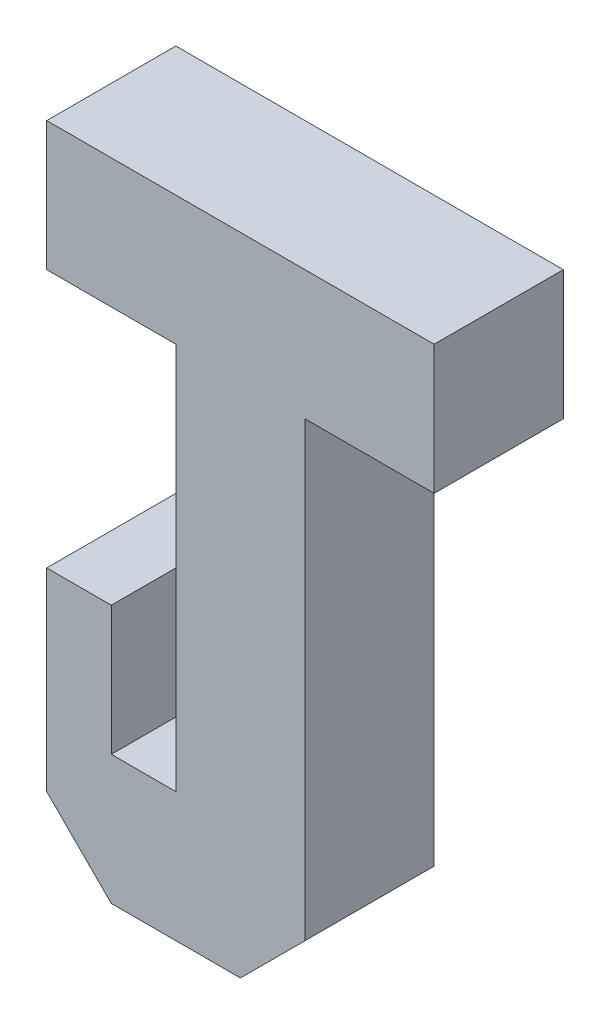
ISO-10303-21;
HEADER;
FILE_DESCRIPTION(('STEP AP214'),'2;1');
FILE_NAME('part.step','',(''),(''),'','','');
FILE_SCHEMA(('AUTOMOTIVE_DESIGN { 1 0 10303 214 1 1 1 1 }'));
ENDSEC;
DATA;
#1=APPLICATION_CONTEXT('core data for automotive mechanical design processes');
#2=APPLICATION_PROTOCOL_DEFINITION('international standard','automotive_design',2000,#1);
#3=PRODUCT_CONTEXT('',#1,'mechanical');
#4=PRODUCT('Part','Part','',(#3));
#5=PRODUCT_RELATED_PRODUCT_CATEGORY('part','',(#4));
#6=PRODUCT_DEFINITION_FORMATION('','',#4);
#7=PRODUCT_DEFINITION_CONTEXT('part definition',#1,'design');
#8=PRODUCT_DEFINITION('design','',#6,#7);
#9=PRODUCT_DEFINITION_SHAPE('','',#8);
#10=(LENGTH_UNIT() NAMED_UNIT(*) SI_UNIT(.MILLI.,.METRE.));
#11=(NAMED_UNIT(*) PLANE_ANGLE_UNIT() SI_UNIT($,.RADIAN.));
#12=(NAMED_UNIT(*) SI_UNIT($,.STERADIAN.) SOLID_ANGLE_UNIT());
#13=UNCERTAINTY_MEASURE_WITH_UNIT(LENGTH_MEASURE(1.E-05),#10,'distance_accuracy_value','');
#14=(GEOMETRIC_REPRESENTATION_CONTEXT(3) GLOBAL_UNCERTAINTY_ASSIGNED_CONTEXT((#13)) GLOBAL_UNIT_ASSIGNED_CONTEXT((#10,
#11,#12)) REPRESENTATION_CONTEXT('',''));
#15=CARTESIAN_POINT('',(0.,0.,0.));
#16=DIRECTION('',(0.,0.,1.));
#17=DIRECTION('',(1.,0.,0.));
#18=AXIS2_PLACEMENT_3D('',#15,#16,#17);
#19=CARTESIAN_POINT('',(-10.,50.,10.));
#20=DIRECTION('',(1.,0.,0.));
#21=DIRECTION('',(0.,1.,0.));
#22=AXIS2_PLACEMENT_3D('',#19,#20,#21);
#23=PLANE('',#22);
#24=DIRECTION('',(0.,-1.,0.));
#25=VECTOR('',#24,1.);
#26=CARTESIAN_POINT('',(-10.,50.,0.));
#27=LINE('',#26,#25);
#28=CARTESIAN_POINT('',(-10.,50.,0.));
#29=VERTEX_POINT('',#28);
#30=CARTESIAN_POINT('',(-10.,40.,0.));
#31=VERTEX_POINT('',#30);
#32=EDGE_CURVE('E159',#29,#31,#27,.T.);
#33=ORIENTED_EDGE('',*,*,#32,.T.);
#34=DIRECTION('',(0.,0.,-1.));
#35=VECTOR('',#34,1.);
#36=CARTESIAN_POINT('',(-10.,40.,10.));
#37=LINE('',#36,#35);
#38=CARTESIAN_POINT('',(-10.,40.,10.));
#39=VERTEX_POINT('',#38);
#40=EDGE_CURVE('E140',#39,#31,#37,.T.);
#41=ORIENTED_EDGE('',*,*,#40,.F.);
#42=DIRECTION('',(0.,-1.,0.));
#43=VECTOR('',#42,1.);
#44=CARTESIAN_POINT('',(-10.,50.,10.));
#45=LINE('',#44,#43);
#46=CARTESIAN_POINT('',(-10.,50.,10.));
#47=VERTEX_POINT('',#46);
#48=EDGE_CURVE('E147',#47,#39,#45,.T.);
#49=ORIENTED_EDGE('',*,*,#48,.F.);
#50=DIRECTION('',(0.,0.,-1.));
#51=VECTOR('',#50,1.);
#52=CARTESIAN_POINT('',(-10.,50.,10.));
#53=LINE('',#52,#51);
#54=EDGE_CURVE('E213',#47,#29,#53,.T.);
#55=ORIENTED_EDGE('',*,*,#54,.T.);
#56=EDGE_LOOP('',(#33,#41,#49,#55));
#57=FACE_BOUND('',#56,.T.);
#58=ADVANCED_FACE('F33',(#57),#23,.F.);
#59=CARTESIAN_POINT('',(-10.,40.,10.));
#60=DIRECTION('',(0.,1.,0.));
#61=DIRECTION('',(-1.,0.,0.));
#62=AXIS2_PLACEMENT_3D('',#59,#60,#61);
#63=PLANE('',#62);
#64=DIRECTION('',(1.,0.,0.));
#65=VECTOR('',#64,1.);
#66=CARTESIAN_POINT('',(-10.,40.,0.));
#67=LINE('',#66,#65);
#68=CARTESIAN_POINT('',(0.,40.,0.));
#69=VERTEX_POINT('',#68);
#70=EDGE_CURVE('E247',#31,#69,#67,.T.);
#71=ORIENTED_EDGE('',*,*,#70,.T.);
#72=DIRECTION('',(0.,0.,-1.));
#73=VECTOR('',#72,1.);
#74=CARTESIAN_POINT('',(0.,40.,10.));
#75=LINE('',#74,#73);
#76=CARTESIAN_POINT('',(0.,40.,10.));
#77=VERTEX_POINT('',#76);
#78=EDGE_CURVE('E143',#77,#69,#75,.T.);
#79=ORIENTED_EDGE('',*,*,#78,.F.);
#80=DIRECTION('',(1.,0.,0.));
#81=VECTOR('',#80,1.);
#82=CARTESIAN_POINT('',(-10.,40.,10.));
#83=LINE('',#82,#81);
#84=EDGE_CURVE('E136',#39,#77,#83,.T.);
#85=ORIENTED_EDGE('',*,*,#84,.F.);
#86=ORIENTED_EDGE('',*,*,#40,.T.);
#87=EDGE_LOOP('',(#71,#79,#85,#86));
#88=FACE_BOUND('',#87,.T.);
#89=ADVANCED_FACE('F138',(#88),#63,.F.);
#90=CARTESIAN_POINT('',(0.,40.,10.));
#91=DIRECTION('',(1.,0.,0.));
#92=DIRECTION('',(0.,1.,0.));
#93=AXIS2_PLACEMENT_3D('',#90,#91,#92);
#94=PLANE('',#93);
#95=DIRECTION('',(0.,-1.,0.));
#96=VECTOR('',#95,1.);
#97=CARTESIAN_POINT('',(0.,40.,0.));
#98=LINE('',#97,#96);
#99=CARTESIAN_POINT('',(0.,10.,0.));
#100=VERTEX_POINT('',#99);
#101=EDGE_CURVE('E242',#69,#100,#98,.T.);
#102=ORIENTED_EDGE('',*,*,#101,.T.);
#103=DIRECTION('',(0.,0.,-1.));
#104=VECTOR('',#103,1.);
#105=CARTESIAN_POINT('',(0.,10.,10.));
#106=LINE('',#105,#104);
#107=CARTESIAN_POINT('',(0.,10.,10.));
#108=VERTEX_POINT('',#107);
#109=EDGE_CURVE('E165',#108,#100,#106,.T.);
#110=ORIENTED_EDGE('',*,*,#109,.F.);
#111=DIRECTION('',(0.,-1.,0.));
#112=VECTOR('',#111,1.);
#113=CARTESIAN_POINT('',(0.,40.,10.));
#114=LINE('',#113,#112);
#115=EDGE_CURVE('E146',#77,#108,#114,.T.);
#116=ORIENTED_EDGE('',*,*,#115,.F.);
#117=ORIENTED_EDGE('',*,*,#78,.T.);
#118=EDGE_LOOP('',(#102,#110,#116,#117));
#119=FACE_BOUND('',#118,.T.);
#120=ADVANCED_FACE('F270',(#119),#94,.F.);
#121=CARTESIAN_POINT('',(0.,10.,10.));
#122=DIRECTION('',(0.,-1.,0.));
#123=DIRECTION('',(0.,0.,-1.));
#124=AXIS2_PLACEMENT_3D('',#121,#122,#123);
#125=PLANE('',#124);
#126=DIRECTION('',(-1.,0.,0.));
#127=VECTOR('',#126,1.);
#128=CARTESIAN_POINT('',(0.,10.,0.));
#129=LINE('',#128,#127);
#130=CARTESIAN_POINT('',(-5.,10.,0.));
#131=VERTEX_POINT('',#130);
#132=EDGE_CURVE('E237',#100,#131,#129,.T.);
#133=ORIENTED_EDGE('',*,*,#132,.T.);
#134=DIRECTION('',(0.,0.,-1.));
#135=VECTOR('',#134,1.);
#136=CARTESIAN_POINT('',(-5.,10.,10.));
#137=LINE('',#136,#135);
#138=CARTESIAN_POINT('',(-5.,10.,10.));
#139=VERTEX_POINT('',#138);
#140=EDGE_CURVE('E228',#139,#131,#137,.T.);
#141=ORIENTED_EDGE('',*,*,#140,.F.);
#142=DIRECTION('',(-1.,0.,0.));
#143=VECTOR('',#142,1.);
#144=CARTESIAN_POINT('',(0.,10.,10.));
#145=LINE('',#144,#143);
#146=EDGE_CURVE('E238',#108,#139,#145,.T.);
#147=ORIENTED_EDGE('',*,*,#146,.F.);
#148=ORIENTED_EDGE('',*,*,#109,.T.);
#149=EDGE_LOOP('',(#133,#141,#147,#148));
#150=FACE_BOUND('',#149,.T.);
#151=ADVANCED_FACE('F235',(#150),#125,.F.);
#152=CARTESIAN_POINT('',(-5.,10.,10.));
#153=DIRECTION('',(-1.,0.,0.));
#154=DIRECTION('',(0.,0.,1.));
#155=AXIS2_PLACEMENT_3D('',#152,#153,#154);
#156=PLANE('',#155);
#157=DIRECTION('',(0.,1.,0.));
#158=VECTOR('',#157,1.);
#159=CARTESIAN_POINT('',(-5.,10.,0.));
#160=LINE('',#159,#158);
#161=CARTESIAN_POINT('',(-5.,20.,0.));
#162=VERTEX_POINT('',#161);
#163=EDGE_CURVE('E244',#131,#162,#160,.T.);
#164=ORIENTED_EDGE('',*,*,#163,.T.);
#165=DIRECTION('',(0.,0.,-1.));
#166=VECTOR('',#165,1.);
#167=CARTESIAN_POINT('',(-5.,20.,10.));
#168=LINE('',#167,#166);
#169=CARTESIAN_POINT('',(-5.,20.,10.));
#170=VERTEX_POINT('',#169);
#171=EDGE_CURVE('E225',#170,#162,#168,.T.);
#172=ORIENTED_EDGE('',*,*,#171,.F.);
#173=DIRECTION('',(0.,1.,0.));
#174=VECTOR('',#173,1.);
#175=CARTESIAN_POINT('',(-5.,10.,10.));
#176=LINE('',#175,#174);
#177=EDGE_CURVE('E262',#139,#170,#176,.T.);
#178=ORIENTED_EDGE('',*,*,#177,.F.);
#179=ORIENTED_EDGE('',*,*,#140,.T.);
#180=EDGE_LOOP('',(#164,#172,#178,#179));
#181=FACE_BOUND('',#180,.T.);
#182=ADVANCED_FACE('F275',(#181),#156,.F.);
#183=CARTESIAN_POINT('',(-10.,20.,10.));
#184=DIRECTION('',(0.,-1.,0.));
#185=DIRECTION('',(0.,0.,-1.));
#186=AXIS2_PLACEMENT_3D('',#183,#184,#185);
#187=PLANE('',#186);
#188=DIRECTION('',(-1.,0.,0.));
#189=VECTOR('',#188,1.);
#190=CARTESIAN_POINT('',(-10.,20.,0.));
#191=LINE('',#190,#189);
#192=CARTESIAN_POINT('',(-10.,20.,0.));
#193=VERTEX_POINT('',#192);
#194=EDGE_CURVE('E205',#162,#193,#191,.T.);
#195=ORIENTED_EDGE('',*,*,#194,.T.);
#196=DIRECTION('',(0.,0.,-1.));
#197=VECTOR('',#196,1.);
#198=CARTESIAN_POINT('',(-10.,20.,10.));
#199=LINE('',#198,#197);
#200=CARTESIAN_POINT('',(-10.,20.,10.));
#201=VERTEX_POINT('',#200);
#202=EDGE_CURVE('E222',#201,#193,#199,.T.);
#203=ORIENTED_EDGE('',*,*,#202,.F.);
#204=DIRECTION('',(-1.,0.,0.));
#205=VECTOR('',#204,1.);
#206=CARTESIAN_POINT('',(-10.,20.,10.));
#207=LINE('',#206,#205);
#208=EDGE_CURVE('E259',#170,#201,#207,.T.);
#209=ORIENTED_EDGE('',*,*,#208,.F.);
#210=ORIENTED_EDGE('',*,*,#171,.T.);
#211=EDGE_LOOP('',(#195,#203,#209,#210));
#212=FACE_BOUND('',#211,.T.);
#213=ADVANCED_FACE('F253',(#212),#187,.F.);
#214=CARTESIAN_POINT('',(-10.,0.,10.));
#215=DIRECTION('',(1.,0.,0.));
#216=DIRECTION('',(0.,0.,-1.));
#217=AXIS2_PLACEMENT_3D('',#214,#215,#216);
#218=PLANE('',#217);
#219=DIRECTION('',(0.,-1.,0.));
#220=VECTOR('',#219,1.);
#221=CARTESIAN_POINT('',(-10.,0.,0.));
#222=LINE('',#221,#220);
#223=CARTESIAN_POINT('',(-10.,5.00000000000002,0.));
#224=VERTEX_POINT('',#223);
#225=EDGE_CURVE('E201',#193,#224,#222,.T.);
#226=ORIENTED_EDGE('',*,*,#225,.T.);
#227=DIRECTION('',(0.,0.,1.));
#228=VECTOR('',#227,1.);
#229=CARTESIAN_POINT('',(-10.,5.00000000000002,10.));
#230=LINE('',#229,#228);
#231=CARTESIAN_POINT('',(-10.,5.00000000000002,10.));
#232=VERTEX_POINT('',#231);
#233=EDGE_CURVE('E11',#224,#232,#230,.T.);
#234=ORIENTED_EDGE('',*,*,#233,.T.);
#235=DIRECTION('',(0.,-1.,0.));
#236=VECTOR('',#235,1.);
#237=CARTESIAN_POINT('',(-10.,10.,10.));
#238=LINE('',#237,#236);
#239=EDGE_CURVE('E257',#201,#232,#238,.T.);
#240=ORIENTED_EDGE('',*,*,#239,.F.);
#241=ORIENTED_EDGE('',*,*,#202,.T.);
#242=EDGE_LOOP('',(#226,#234,#240,#241));
#243=FACE_BOUND('',#242,.T.);
#244=ADVANCED_FACE('F256',(#243),#218,.F.);
#245=CARTESIAN_POINT('',(0.,0.,10.));
#246=DIRECTION('',(0.,1.,0.));
#247=DIRECTION('',(0.,0.,1.));
#248=AXIS2_PLACEMENT_3D('',#245,#246,#247);
#249=PLANE('',#248);
#250=DIRECTION('',(1.,0.,0.));
#251=VECTOR('',#250,1.);
#252=CARTESIAN_POINT('',(0.,0.,0.));
#253=LINE('',#252,#251);
#254=CARTESIAN_POINT('',(-5.,0.,0.));
#255=VERTEX_POINT('',#254);
#256=CARTESIAN_POINT('',(4.99999999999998,0.,0.));
#257=VERTEX_POINT('',#256);
#258=EDGE_CURVE('E196',#255,#257,#253,.T.);
#259=ORIENTED_EDGE('',*,*,#258,.T.);
#260=DIRECTION('',(0.,0.,1.));
#261=VECTOR('',#260,1.);
#262=CARTESIAN_POINT('',(4.99999999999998,0.,10.));
#263=LINE('',#262,#261);
#264=CARTESIAN_POINT('',(4.99999999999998,0.,10.));
#265=VERTEX_POINT('',#264);
#266=EDGE_CURVE('E54',#257,#265,#263,.T.);
#267=ORIENTED_EDGE('',*,*,#266,.T.);
#268=DIRECTION('',(1.,0.,0.));
#269=VECTOR('',#268,1.);
#270=CARTESIAN_POINT('',(0.,0.,10.));
#271=LINE('',#270,#269);
#272=CARTESIAN_POINT('',(-4.99999999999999,0.,10.));
#273=VERTEX_POINT('',#272);
#274=EDGE_CURVE('E181',#273,#265,#271,.T.);
#275=ORIENTED_EDGE('',*,*,#274,.F.);
#276=DIRECTION('',(0.,0.,-1.));
#277=VECTOR('',#276,1.);
#278=CARTESIAN_POINT('',(-5.,0.,10.));
#279=LINE('',#278,#277);
#280=EDGE_CURVE('E172',#273,#255,#279,.T.);
#281=ORIENTED_EDGE('',*,*,#280,.T.);
#282=EDGE_LOOP('',(#259,#267,#275,#281));
#283=FACE_BOUND('',#282,.T.);
#284=ADVANCED_FACE('F199',(#283),#249,.F.);
#285=CARTESIAN_POINT('',(10.,40.,10.));
#286=DIRECTION('',(-1.,0.,0.));
#287=DIRECTION('',(0.,-1.,0.));
#288=AXIS2_PLACEMENT_3D('',#285,#286,#287);
#289=PLANE('',#288);
#290=DIRECTION('',(0.,1.,0.));
#291=VECTOR('',#290,1.);
#292=CARTESIAN_POINT('',(10.,40.,10.));
#293=LINE('',#292,#291);
#294=CARTESIAN_POINT('',(10.,5.00000000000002,10.));
#295=VERTEX_POINT('',#294);
#296=CARTESIAN_POINT('',(10.,40.,10.));
#297=VERTEX_POINT('',#296);
#298=EDGE_CURVE('E179',#295,#297,#293,.T.);
#299=ORIENTED_EDGE('',*,*,#298,.F.);
#300=DIRECTION('',(0.,0.,-1.));
#301=VECTOR('',#300,1.);
#302=CARTESIAN_POINT('',(10.,5.,10.));
#303=LINE('',#302,#301);
#304=CARTESIAN_POINT('',(10.,5.00000000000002,0.));
#305=VERTEX_POINT('',#304);
#306=EDGE_CURVE('E160',#295,#305,#303,.T.);
#307=ORIENTED_EDGE('',*,*,#306,.T.);
#308=DIRECTION('',(0.,1.,0.));
#309=VECTOR('',#308,1.);
#310=CARTESIAN_POINT('',(10.,40.,0.));
#311=LINE('',#310,#309);
#312=CARTESIAN_POINT('',(10.,40.,0.));
#313=VERTEX_POINT('',#312);
#314=EDGE_CURVE('E198',#305,#313,#311,.T.);
#315=ORIENTED_EDGE('',*,*,#314,.T.);
#316=DIRECTION('',(0.,0.,-1.));
#317=VECTOR('',#316,1.);
#318=CARTESIAN_POINT('',(10.,40.,10.));
#319=LINE('',#318,#317);
#320=EDGE_CURVE('E188',#297,#313,#319,.T.);
#321=ORIENTED_EDGE('',*,*,#320,.F.);
#322=EDGE_LOOP('',(#299,#307,#315,#321));
#323=FACE_BOUND('',#322,.T.);
#324=ADVANCED_FACE('F185',(#323),#289,.F.);
#325=CARTESIAN_POINT('',(10.,40.,10.));
#326=DIRECTION('',(0.,1.,0.));
#327=DIRECTION('',(-1.,0.,0.));
#328=AXIS2_PLACEMENT_3D('',#325,#326,#327);
#329=PLANE('',#328);
#330=DIRECTION('',(1.,0.,0.));
#331=VECTOR('',#330,1.);
#332=CARTESIAN_POINT('',(10.,40.,0.));
#333=LINE('',#332,#331);
#334=CARTESIAN_POINT('',(20.,40.,0.));
#335=VERTEX_POINT('',#334);
#336=EDGE_CURVE('E203',#313,#335,#333,.T.);
#337=ORIENTED_EDGE('',*,*,#336,.T.);
#338=DIRECTION('',(0.,0.,-1.));
#339=VECTOR('',#338,1.);
#340=CARTESIAN_POINT('',(20.,40.,10.));
#341=LINE('',#340,#339);
#342=CARTESIAN_POINT('',(20.,40.,10.));
#343=VERTEX_POINT('',#342);
#344=EDGE_CURVE('E218',#343,#335,#341,.T.);
#345=ORIENTED_EDGE('',*,*,#344,.F.);
#346=DIRECTION('',(1.,0.,0.));
#347=VECTOR('',#346,1.);
#348=CARTESIAN_POINT('',(10.,40.,10.));
#349=LINE('',#348,#347);
#350=EDGE_CURVE('E190',#297,#343,#349,.T.);
#351=ORIENTED_EDGE('',*,*,#350,.F.);
#352=ORIENTED_EDGE('',*,*,#320,.T.);
#353=EDGE_LOOP('',(#337,#345,#351,#352));
#354=FACE_BOUND('',#353,.T.);
#355=ADVANCED_FACE('F310',(#354),#329,.F.);
#356=CARTESIAN_POINT('',(20.,50.,10.));
#357=DIRECTION('',(-1.,0.,0.));
#358=DIRECTION('',(0.,0.,1.));
#359=AXIS2_PLACEMENT_3D('',#356,#357,#358);
#360=PLANE('',#359);
#361=DIRECTION('',(0.,1.,0.));
#362=VECTOR('',#361,1.);
#363=CARTESIAN_POINT('',(20.,50.,0.));
#364=LINE('',#363,#362);
#365=CARTESIAN_POINT('',(20.,50.,0.));
#366=VERTEX_POINT('',#365);
#367=EDGE_CURVE('E210',#335,#366,#364,.T.);
#368=ORIENTED_EDGE('',*,*,#367,.T.);
#369=DIRECTION('',(0.,0.,-1.));
#370=VECTOR('',#369,1.);
#371=CARTESIAN_POINT('',(20.,50.,10.));
#372=LINE('',#371,#370);
#373=CARTESIAN_POINT('',(20.,50.,10.));
#374=VERTEX_POINT('',#373);
#375=EDGE_CURVE('E215',#374,#366,#372,.T.);
#376=ORIENTED_EDGE('',*,*,#375,.F.);
#377=DIRECTION('',(0.,1.,0.));
#378=VECTOR('',#377,1.);
#379=CARTESIAN_POINT('',(20.,50.,10.));
#380=LINE('',#379,#378);
#381=EDGE_CURVE('E267',#343,#374,#380,.T.);
#382=ORIENTED_EDGE('',*,*,#381,.F.);
#383=ORIENTED_EDGE('',*,*,#344,.T.);
#384=EDGE_LOOP('',(#368,#376,#382,#383));
#385=FACE_BOUND('',#384,.T.);
#386=ADVANCED_FACE('F306',(#385),#360,.F.);
#387=CARTESIAN_POINT('',(-10.,50.,10.));
#388=DIRECTION('',(0.,-1.,0.));
#389=DIRECTION('',(1.,0.,0.));
#390=AXIS2_PLACEMENT_3D('',#387,#388,#389);
#391=PLANE('',#390);
#392=DIRECTION('',(-1.,0.,0.));
#393=VECTOR('',#392,1.);
#394=CARTESIAN_POINT('',(-10.,50.,0.));
#395=LINE('',#394,#393);
#396=EDGE_CURVE('E156',#366,#29,#395,.T.);
#397=ORIENTED_EDGE('',*,*,#396,.T.);
#398=ORIENTED_EDGE('',*,*,#54,.F.);
#399=DIRECTION('',(-1.,0.,0.));
#400=VECTOR('',#399,1.);
#401=CARTESIAN_POINT('',(-10.,50.,10.));
#402=LINE('',#401,#400);
#403=EDGE_CURVE('E152',#374,#47,#402,.T.);
#404=ORIENTED_EDGE('',*,*,#403,.F.);
#405=ORIENTED_EDGE('',*,*,#375,.T.);
#406=EDGE_LOOP('',(#397,#398,#404,#405));
#407=FACE_BOUND('',#406,.T.);
#408=ADVANCED_FACE('F301',(#407),#391,.F.);
#409=CARTESIAN_POINT('',(0.,0.,10.));
#410=DIRECTION('',(0.,0.,1.));
#411=DIRECTION('',(1.,0.,0.));
#412=AXIS2_PLACEMENT_3D('',#409,#410,#411);
#413=PLANE('',#412);
#414=ORIENTED_EDGE('',*,*,#274,.T.);
#415=DIRECTION('',(-0.707106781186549,-0.707106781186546,0.));
#416=VECTOR('',#415,1.);
#417=CARTESIAN_POINT('',(2.49999999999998,-2.49999999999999,10.));
#418=LINE('',#417,#416);
#419=EDGE_CURVE('E41',#265,#295,#418,.F.);
#420=ORIENTED_EDGE('',*,*,#419,.T.);
#421=ORIENTED_EDGE('',*,*,#298,.T.);
#422=ORIENTED_EDGE('',*,*,#350,.T.);
#423=ORIENTED_EDGE('',*,*,#381,.T.);
#424=ORIENTED_EDGE('',*,*,#403,.T.);
#425=ORIENTED_EDGE('',*,*,#48,.T.);
#426=ORIENTED_EDGE('',*,*,#84,.T.);
#427=ORIENTED_EDGE('',*,*,#115,.T.);
#428=ORIENTED_EDGE('',*,*,#146,.T.);
#429=ORIENTED_EDGE('',*,*,#177,.T.);
#430=ORIENTED_EDGE('',*,*,#208,.T.);
#431=ORIENTED_EDGE('',*,*,#239,.T.);
#432=DIRECTION('',(-0.707106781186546,0.707106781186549,0.));
#433=VECTOR('',#432,1.);
#434=CARTESIAN_POINT('',(-2.50000000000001,-2.5,10.));
#435=LINE('',#434,#433);
#436=EDGE_CURVE('E176',#232,#273,#435,.F.);
#437=ORIENTED_EDGE('',*,*,#436,.T.);
#438=EDGE_LOOP('',(#414,#420,#421,#422,#423,#424,#425,#426,#427,#428,#429,#430,#431,#437));
#439=FACE_BOUND('',#438,.T.);
#440=ADVANCED_FACE('F150',(#439),#413,.T.);
#441=CARTESIAN_POINT('',(0.,0.,0.));
#442=DIRECTION('',(0.,0.,1.));
#443=DIRECTION('',(1.,0.,0.));
#444=AXIS2_PLACEMENT_3D('',#441,#442,#443);
#445=PLANE('',#444);
#446=ORIENTED_EDGE('',*,*,#314,.F.);
#447=DIRECTION('',(0.707106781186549,0.707106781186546,0.));
#448=VECTOR('',#447,1.);
#449=CARTESIAN_POINT('',(10.,5.,0.));
#450=LINE('',#449,#448);
#451=EDGE_CURVE('E170',#305,#257,#450,.F.);
#452=ORIENTED_EDGE('',*,*,#451,.T.);
#453=ORIENTED_EDGE('',*,*,#258,.F.);
#454=DIRECTION('',(0.707106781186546,-0.707106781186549,0.));
#455=VECTOR('',#454,1.);
#456=CARTESIAN_POINT('',(-5.,0.,0.));
#457=LINE('',#456,#455);
#458=EDGE_CURVE('E163',#255,#224,#457,.F.);
#459=ORIENTED_EDGE('',*,*,#458,.T.);
#460=ORIENTED_EDGE('',*,*,#225,.F.);
#461=ORIENTED_EDGE('',*,*,#194,.F.);
#462=ORIENTED_EDGE('',*,*,#163,.F.);
#463=ORIENTED_EDGE('',*,*,#132,.F.);
#464=ORIENTED_EDGE('',*,*,#101,.F.);
#465=ORIENTED_EDGE('',*,*,#70,.F.);
#466=ORIENTED_EDGE('',*,*,#32,.F.);
#467=ORIENTED_EDGE('',*,*,#396,.F.);
#468=ORIENTED_EDGE('',*,*,#367,.F.);
#469=ORIENTED_EDGE('',*,*,#336,.F.);
#470=EDGE_LOOP('',(#446,#452,#453,#459,#460,#461,#462,#463,#464,#465,#466,#467,#468,#469));
#471=FACE_BOUND('',#470,.T.);
#472=ADVANCED_FACE('F195',(#471),#445,.F.);
#473=CARTESIAN_POINT('',(10.,5.,10.));
#474=DIRECTION('',(-0.707106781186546,0.707106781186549,0.));
#475=DIRECTION('',(0.,0.,-1.));
#476=AXIS2_PLACEMENT_3D('',#473,#474,#475);
#477=PLANE('',#476);
#478=ORIENTED_EDGE('',*,*,#419,.F.);
#479=ORIENTED_EDGE('',*,*,#266,.F.);
#480=ORIENTED_EDGE('',*,*,#451,.F.);
#481=ORIENTED_EDGE('',*,*,#306,.F.);
#482=EDGE_LOOP('',(#478,#479,#480,#481));
#483=FACE_BOUND('',#482,.T.);
#484=ADVANCED_FACE('F192',(#483),#477,.F.);
#485=CARTESIAN_POINT('',(-5.,0.,10.));
#486=DIRECTION('',(0.707106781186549,0.707106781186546,0.));
#487=DIRECTION('',(0.,0.,-1.));
#488=AXIS2_PLACEMENT_3D('',#485,#486,#487);
#489=PLANE('',#488);
#490=ORIENTED_EDGE('',*,*,#436,.F.);
#491=ORIENTED_EDGE('',*,*,#233,.F.);
#492=ORIENTED_EDGE('',*,*,#458,.F.);
#493=ORIENTED_EDGE('',*,*,#280,.F.);
#494=EDGE_LOOP('',(#490,#491,#492,#493));
#495=FACE_BOUND('',#494,.T.);
#496=ADVANCED_FACE('F35',(#495),#489,.F.);
#497=CLOSED_SHELL('',(#58,#89,#120,#151,#182,#213,#244,#284,#324,#355,#386,#408,#440,#472,#484,#496));
#498=MANIFOLD_SOLID_BREP('B2',#497);
#499=ADVANCED_BREP_SHAPE_REPRESENTATION('',(#18,#498),#14);
#500=SHAPE_DEFINITION_REPRESENTATION(#9,#499);
ENDSEC;
END-ISO-10303-21;
